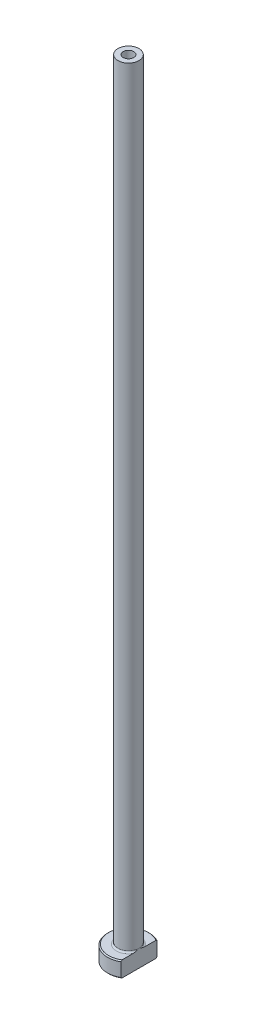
from build123d import *

# Parameters (mm, degrees)
FILLET1_R          = 0.3
CHAMFER1_SIZE      = 0.2
CUT_EXTRUDE1_DEPTH = 151.106628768
CHAMFER2_SIZE      = 0.5


with BuildPart() as part:
    # Sketch1 → Revolve1 (revolve)
    with BuildSketch(Plane.XY, mode=Mode.PRIVATE) as revolve1_sk:
        Polygon((-1, 150), (-2, 150), (-2, 3), (-4, 3), (-4, 0), (-1.25, 0), (-1.25, 103), (-1, 115), align=None)
    revolve(revolve1_sk.sketch.rotate(Axis((0, 92.187680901, 0), (0, -1, 0)), 270), axis=Axis((0, 92.187680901, 0), (0, -1, 0)))

    # Fillet1
    fillet1_edges = [part.edges().sort_by_distance(p)[0] for p in [
        (0, 3, -2),
    ]]
    fillet(fillet1_edges, radius=FILLET1_R)

    # Chamfer1
    chamfer1_edges = [part.edges().sort_by_distance(p)[0] for p in [
        (0, 0, -4),
        (0, 3, -4),
    ]]
    chamfer(chamfer1_edges, length=CHAMFER1_SIZE)

    # Sketch2 → Cut-Extrude1 (cut, through all)
    with BuildSketch(Plane.XZ):
        with BuildLine():
            Line((2, 3.464101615), (2, -3.464101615))
            ThreePointArc((2, -3.464101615), (4, 0), (2, 3.464101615))
        make_face()
    extrude(amount=-CUT_EXTRUDE1_DEPTH, mode=Mode.SUBTRACT)

    # Chamfer2
    chamfer2_edges = [part.edges().sort_by_distance(p)[0] for p in [
        (0, 0, -1.25),
    ]]
    chamfer(chamfer2_edges, length=CHAMFER2_SIZE)


solid = part.part
